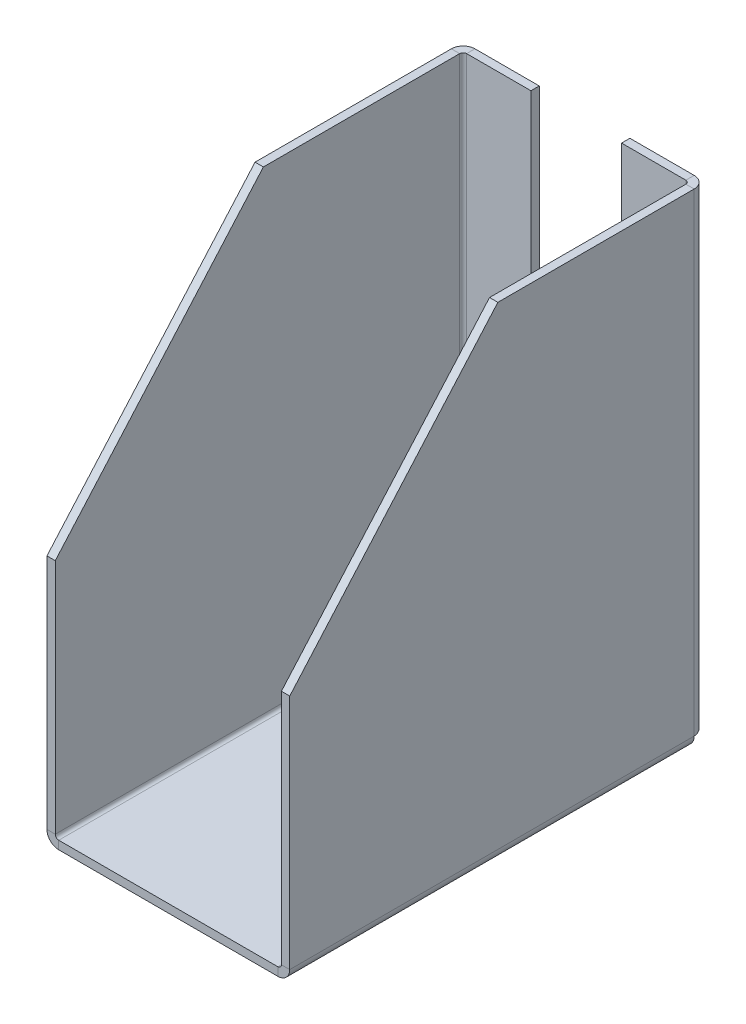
ISO-10303-21;
HEADER;
FILE_DESCRIPTION(('STEP AP214'),'2;1');
FILE_NAME('part.step','',(''),(''),'','','');
FILE_SCHEMA(('AUTOMOTIVE_DESIGN { 1 0 10303 214 1 1 1 1 }'));
ENDSEC;
DATA;
#1=APPLICATION_CONTEXT('core data for automotive mechanical design processes');
#2=APPLICATION_PROTOCOL_DEFINITION('international standard','automotive_design',2000,#1);
#3=PRODUCT_CONTEXT('',#1,'mechanical');
#4=PRODUCT('Part','Part','',(#3));
#5=PRODUCT_RELATED_PRODUCT_CATEGORY('part','',(#4));
#6=PRODUCT_DEFINITION_FORMATION('','',#4);
#7=PRODUCT_DEFINITION_CONTEXT('part definition',#1,'design');
#8=PRODUCT_DEFINITION('design','',#6,#7);
#9=PRODUCT_DEFINITION_SHAPE('','',#8);
#10=(LENGTH_UNIT() NAMED_UNIT(*) SI_UNIT(.MILLI.,.METRE.));
#11=(NAMED_UNIT(*) PLANE_ANGLE_UNIT() SI_UNIT($,.RADIAN.));
#12=(NAMED_UNIT(*) SI_UNIT($,.STERADIAN.) SOLID_ANGLE_UNIT());
#13=UNCERTAINTY_MEASURE_WITH_UNIT(LENGTH_MEASURE(1.E-05),#10,'distance_accuracy_value','');
#14=(GEOMETRIC_REPRESENTATION_CONTEXT(3) GLOBAL_UNCERTAINTY_ASSIGNED_CONTEXT((#13)) GLOBAL_UNIT_ASSIGNED_CONTEXT((#10,
#11,#12)) REPRESENTATION_CONTEXT('',''));
#15=CARTESIAN_POINT('',(0.,0.,0.));
#16=DIRECTION('',(0.,0.,1.));
#17=DIRECTION('',(1.,0.,0.));
#18=AXIS2_PLACEMENT_3D('',#15,#16,#17);
#19=CARTESIAN_POINT('',(22.225,0.,76.2));
#20=DIRECTION('',(1.,0.,0.));
#21=DIRECTION('',(0.,0.,-1.));
#22=AXIS2_PLACEMENT_3D('',#19,#20,#21);
#23=PLANE('',#22);
#24=DIRECTION('',(0.,0.,-1.));
#25=VECTOR('',#24,1.);
#26=CARTESIAN_POINT('',(22.225,2.159,76.2));
#27=LINE('',#26,#25);
#28=CARTESIAN_POINT('',(22.225,2.159,76.2));
#29=VERTEX_POINT('',#28);
#30=CARTESIAN_POINT('',(22.225,2.15899999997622,2.159));
#31=VERTEX_POINT('',#30);
#32=EDGE_CURVE('E213',#29,#31,#27,.T.);
#33=ORIENTED_EDGE('',*,*,#32,.T.);
#34=DIRECTION('',(0.,1.,0.));
#35=VECTOR('',#34,1.);
#36=CARTESIAN_POINT('',(22.225,2.15899999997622,2.159));
#37=LINE('',#36,#35);
#38=CARTESIAN_POINT('',(22.225,88.9,2.159));
#39=VERTEX_POINT('',#38);
#40=EDGE_CURVE('E217',#31,#39,#37,.T.);
#41=ORIENTED_EDGE('',*,*,#40,.T.);
#42=DIRECTION('',(0.,0.,-1.));
#43=VECTOR('',#42,1.);
#44=CARTESIAN_POINT('',(22.225,88.9,76.2));
#45=LINE('',#44,#43);
#46=CARTESIAN_POINT('',(22.225,88.9,38.1));
#47=VERTEX_POINT('',#46);
#48=EDGE_CURVE('E227',#47,#39,#45,.T.);
#49=ORIENTED_EDGE('',*,*,#48,.F.);
#50=DIRECTION('',(0.,0.75128058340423,-0.659982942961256));
#51=VECTOR('',#50,1.);
#52=CARTESIAN_POINT('',(22.225,19.8316251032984,98.7749999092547));
#53=LINE('',#52,#51);
#54=CARTESIAN_POINT('',(22.225,45.5295,76.2));
#55=VERTEX_POINT('',#54);
#56=EDGE_CURVE('E422',#55,#47,#53,.T.);
#57=ORIENTED_EDGE('',*,*,#56,.F.);
#58=DIRECTION('',(0.,-1.,0.));
#59=VECTOR('',#58,1.);
#60=CARTESIAN_POINT('',(22.225,0.,76.2));
#61=LINE('',#60,#59);
#62=EDGE_CURVE('E221',#55,#29,#61,.T.);
#63=ORIENTED_EDGE('',*,*,#62,.T.);
#64=EDGE_LOOP('',(#33,#41,#49,#57,#63));
#65=FACE_BOUND('',#64,.T.);
#66=ADVANCED_FACE('F39',(#65),#23,.T.);
#67=CARTESIAN_POINT('',(20.701,88.9,76.2));
#68=DIRECTION('',(0.,1.,0.));
#69=DIRECTION('',(-1.,0.,0.));
#70=AXIS2_PLACEMENT_3D('',#67,#68,#69);
#71=PLANE('',#70);
#72=ORIENTED_EDGE('',*,*,#48,.T.);
#73=DIRECTION('',(-1.,0.,0.));
#74=VECTOR('',#73,1.);
#75=CARTESIAN_POINT('',(22.225,88.9000000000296,2.159));
#76=LINE('',#75,#74);
#77=CARTESIAN_POINT('',(20.701,88.9,2.159));
#78=VERTEX_POINT('',#77);
#79=EDGE_CURVE('E250',#39,#78,#76,.T.);
#80=ORIENTED_EDGE('',*,*,#79,.T.);
#81=DIRECTION('',(0.,0.,-1.));
#82=VECTOR('',#81,1.);
#83=CARTESIAN_POINT('',(20.701,88.9,76.2));
#84=LINE('',#83,#82);
#85=CARTESIAN_POINT('',(20.701,88.9,38.1));
#86=VERTEX_POINT('',#85);
#87=EDGE_CURVE('E468',#86,#78,#84,.T.);
#88=ORIENTED_EDGE('',*,*,#87,.F.);
#89=DIRECTION('',(-1.,0.,0.));
#90=VECTOR('',#89,1.);
#91=CARTESIAN_POINT('',(20.701,88.9,38.1));
#92=LINE('',#91,#90);
#93=EDGE_CURVE('E427',#86,#47,#92,.F.);
#94=ORIENTED_EDGE('',*,*,#93,.T.);
#95=EDGE_LOOP('',(#72,#80,#88,#94));
#96=FACE_BOUND('',#95,.T.);
#97=ADVANCED_FACE('F558',(#96),#71,.T.);
#98=CARTESIAN_POINT('',(20.701,0.,76.2));
#99=DIRECTION('',(1.,0.,0.));
#100=DIRECTION('',(0.,0.,-1.));
#101=AXIS2_PLACEMENT_3D('',#98,#99,#100);
#102=PLANE('',#101);
#103=DIRECTION('',(0.,1.,0.));
#104=VECTOR('',#103,1.);
#105=CARTESIAN_POINT('',(20.701,2.15899999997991,2.159));
#106=LINE('',#105,#104);
#107=CARTESIAN_POINT('',(20.701,2.159,2.159));
#108=VERTEX_POINT('',#107);
#109=EDGE_CURVE('E265',#108,#78,#106,.T.);
#110=ORIENTED_EDGE('',*,*,#109,.F.);
#111=DIRECTION('',(0.,0.,-1.));
#112=VECTOR('',#111,1.);
#113=CARTESIAN_POINT('',(20.701,2.159,76.2));
#114=LINE('',#113,#112);
#115=CARTESIAN_POINT('',(20.701,2.159,76.2));
#116=VERTEX_POINT('',#115);
#117=EDGE_CURVE('E465',#116,#108,#114,.T.);
#118=ORIENTED_EDGE('',*,*,#117,.F.);
#119=DIRECTION('',(0.,1.,0.));
#120=VECTOR('',#119,1.);
#121=CARTESIAN_POINT('',(20.701,0.,76.2));
#122=LINE('',#121,#120);
#123=CARTESIAN_POINT('',(20.701,45.5295,76.2));
#124=VERTEX_POINT('',#123);
#125=EDGE_CURVE('E446',#124,#116,#122,.F.);
#126=ORIENTED_EDGE('',*,*,#125,.F.);
#127=DIRECTION('',(0.,0.75128058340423,-0.659982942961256));
#128=VECTOR('',#127,1.);
#129=CARTESIAN_POINT('',(20.701,19.8316251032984,98.7749999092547));
#130=LINE('',#129,#128);
#131=EDGE_CURVE('E420',#124,#86,#130,.T.);
#132=ORIENTED_EDGE('',*,*,#131,.T.);
#133=ORIENTED_EDGE('',*,*,#87,.T.);
#134=EDGE_LOOP('',(#110,#118,#126,#132,#133));
#135=FACE_BOUND('',#134,.T.);
#136=ADVANCED_FACE('F498',(#135),#102,.F.);
#137=CARTESIAN_POINT('',(-22.225,0.,76.2));
#138=DIRECTION('',(0.,-1.,0.));
#139=DIRECTION('',(0.,0.,-1.));
#140=AXIS2_PLACEMENT_3D('',#137,#138,#139);
#141=PLANE('',#140);
#142=DIRECTION('',(0.,0.,-1.));
#143=VECTOR('',#142,1.);
#144=CARTESIAN_POINT('',(-20.066,0.,76.2));
#145=LINE('',#144,#143);
#146=CARTESIAN_POINT('',(-20.066,0.,76.2));
#147=VERTEX_POINT('',#146);
#148=CARTESIAN_POINT('',(-20.066,0.,2.159));
#149=VERTEX_POINT('',#148);
#150=EDGE_CURVE('E473',#147,#149,#145,.T.);
#151=ORIENTED_EDGE('',*,*,#150,.T.);
#152=DIRECTION('',(1.,0.,0.));
#153=VECTOR('',#152,1.);
#154=CARTESIAN_POINT('',(-20.0660000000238,0.,2.159));
#155=LINE('',#154,#153);
#156=CARTESIAN_POINT('',(20.066,0.,2.159));
#157=VERTEX_POINT('',#156);
#158=EDGE_CURVE('E299',#149,#157,#155,.T.);
#159=ORIENTED_EDGE('',*,*,#158,.T.);
#160=DIRECTION('',(0.,0.,-1.));
#161=VECTOR('',#160,1.);
#162=CARTESIAN_POINT('',(20.066,0.,76.2));
#163=LINE('',#162,#161);
#164=CARTESIAN_POINT('',(20.066,0.,76.2));
#165=VERTEX_POINT('',#164);
#166=EDGE_CURVE('E226',#165,#157,#163,.T.);
#167=ORIENTED_EDGE('',*,*,#166,.F.);
#168=DIRECTION('',(-1.,0.,0.));
#169=VECTOR('',#168,1.);
#170=CARTESIAN_POINT('',(-22.225,0.,76.2));
#171=LINE('',#170,#169);
#172=EDGE_CURVE('E440',#165,#147,#171,.T.);
#173=ORIENTED_EDGE('',*,*,#172,.T.);
#174=EDGE_LOOP('',(#151,#159,#167,#173));
#175=FACE_BOUND('',#174,.T.);
#176=ADVANCED_FACE('F513',(#175),#141,.T.);
#177=CARTESIAN_POINT('',(20.066,2.159,76.2));
#178=DIRECTION('',(0.,0.,-1.));
#179=DIRECTION('',(-1.,0.,0.));
#180=AXIS2_PLACEMENT_3D('',#177,#178,#179);
#181=CYLINDRICAL_SURFACE('',#180,2.159);
#182=ORIENTED_EDGE('',*,*,#166,.T.);
#183=CARTESIAN_POINT('',(20.066,2.159,2.159));
#184=DIRECTION('',(0.,0.,1.));
#185=DIRECTION('',(1.,0.,0.));
#186=AXIS2_PLACEMENT_3D('',#183,#184,#185);
#187=CIRCLE('',#186,2.159);
#188=EDGE_CURVE('E230',#31,#157,#187,.F.);
#189=ORIENTED_EDGE('',*,*,#188,.F.);
#190=ORIENTED_EDGE('',*,*,#32,.F.);
#191=CARTESIAN_POINT('',(20.066,2.159,76.2));
#192=DIRECTION('',(0.,0.,1.));
#193=DIRECTION('',(1.,0.,0.));
#194=AXIS2_PLACEMENT_3D('',#191,#192,#193);
#195=CIRCLE('',#194,2.159);
#196=EDGE_CURVE('E443',#29,#165,#195,.F.);
#197=ORIENTED_EDGE('',*,*,#196,.T.);
#198=EDGE_LOOP('',(#182,#189,#190,#197));
#199=FACE_BOUND('',#198,.T.);
#200=ADVANCED_FACE('F232',(#199),#181,.T.);
#201=CARTESIAN_POINT('',(20.066,2.159,76.2));
#202=DIRECTION('',(0.,0.,-1.));
#203=DIRECTION('',(-1.,0.,0.));
#204=AXIS2_PLACEMENT_3D('',#201,#202,#203);
#205=CYLINDRICAL_SURFACE('',#204,0.635);
#206=CARTESIAN_POINT('',(20.066,2.159,2.159));
#207=DIRECTION('',(0.,0.,1.));
#208=DIRECTION('',(1.,0.,0.));
#209=AXIS2_PLACEMENT_3D('',#206,#207,#208);
#210=CIRCLE('',#209,0.635);
#211=CARTESIAN_POINT('',(20.066,1.524,2.159));
#212=VERTEX_POINT('',#211);
#213=EDGE_CURVE('E237',#108,#212,#210,.F.);
#214=ORIENTED_EDGE('',*,*,#213,.T.);
#215=DIRECTION('',(0.,0.,-1.));
#216=VECTOR('',#215,1.);
#217=CARTESIAN_POINT('',(20.066,1.524,76.2));
#218=LINE('',#217,#216);
#219=CARTESIAN_POINT('',(20.066,1.524,76.2));
#220=VERTEX_POINT('',#219);
#221=EDGE_CURVE('E462',#220,#212,#218,.T.);
#222=ORIENTED_EDGE('',*,*,#221,.F.);
#223=CARTESIAN_POINT('',(20.066,2.159,76.2));
#224=DIRECTION('',(0.,0.,1.));
#225=DIRECTION('',(1.,0.,0.));
#226=AXIS2_PLACEMENT_3D('',#223,#224,#225);
#227=CIRCLE('',#226,0.635);
#228=EDGE_CURVE('E448',#116,#220,#227,.F.);
#229=ORIENTED_EDGE('',*,*,#228,.F.);
#230=ORIENTED_EDGE('',*,*,#117,.T.);
#231=EDGE_LOOP('',(#214,#222,#229,#230));
#232=FACE_BOUND('',#231,.T.);
#233=ADVANCED_FACE('F501',(#232),#205,.F.);
#234=CARTESIAN_POINT('',(-22.225,1.524,76.2));
#235=DIRECTION('',(0.,-1.,0.));
#236=DIRECTION('',(0.,0.,-1.));
#237=AXIS2_PLACEMENT_3D('',#234,#235,#236);
#238=PLANE('',#237);
#239=DIRECTION('',(1.,0.,0.));
#240=VECTOR('',#239,1.);
#241=CARTESIAN_POINT('',(-20.0660000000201,1.524,2.159));
#242=LINE('',#241,#240);
#243=CARTESIAN_POINT('',(-20.0660000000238,1.524,2.159));
#244=VERTEX_POINT('',#243);
#245=EDGE_CURVE('E301',#244,#212,#242,.T.);
#246=ORIENTED_EDGE('',*,*,#245,.F.);
#247=DIRECTION('',(0.,0.,-1.));
#248=VECTOR('',#247,1.);
#249=CARTESIAN_POINT('',(-20.066,1.524,76.2));
#250=LINE('',#249,#248);
#251=CARTESIAN_POINT('',(-20.066,1.524,76.2));
#252=VERTEX_POINT('',#251);
#253=EDGE_CURVE('E460',#252,#244,#250,.T.);
#254=ORIENTED_EDGE('',*,*,#253,.F.);
#255=DIRECTION('',(1.,0.,0.));
#256=VECTOR('',#255,1.);
#257=CARTESIAN_POINT('',(-22.225,1.524,76.2));
#258=LINE('',#257,#256);
#259=EDGE_CURVE('E451',#220,#252,#258,.F.);
#260=ORIENTED_EDGE('',*,*,#259,.F.);
#261=ORIENTED_EDGE('',*,*,#221,.T.);
#262=EDGE_LOOP('',(#246,#254,#260,#261));
#263=FACE_BOUND('',#262,.T.);
#264=ADVANCED_FACE('F506',(#263),#238,.F.);
#265=CARTESIAN_POINT('',(-20.066,1.524,76.2));
#266=DIRECTION('',(0.,0.,1.));
#267=DIRECTION('',(1.,0.,0.));
#268=AXIS2_PLACEMENT_3D('',#265,#266,#267);
#269=PLANE('',#268);
#270=DIRECTION('',(0.,1.,0.));
#271=VECTOR('',#270,1.);
#272=CARTESIAN_POINT('',(-20.701,0.,76.2));
#273=LINE('',#272,#271);
#274=CARTESIAN_POINT('',(-20.701,2.159,76.2));
#275=VERTEX_POINT('',#274);
#276=CARTESIAN_POINT('',(-20.701,45.5295,76.2));
#277=VERTEX_POINT('',#276);
#278=EDGE_CURVE('E430',#275,#277,#273,.T.);
#279=ORIENTED_EDGE('',*,*,#278,.T.);
#280=DIRECTION('',(1.,0.,0.));
#281=VECTOR('',#280,1.);
#282=CARTESIAN_POINT('',(-20.701,45.5295,76.2));
#283=LINE('',#282,#281);
#284=CARTESIAN_POINT('',(-22.225,45.5295,76.2));
#285=VERTEX_POINT('',#284);
#286=EDGE_CURVE('E417',#277,#285,#283,.F.);
#287=ORIENTED_EDGE('',*,*,#286,.T.);
#288=DIRECTION('',(0.,1.,0.));
#289=VECTOR('',#288,1.);
#290=CARTESIAN_POINT('',(-22.225,0.,76.2));
#291=LINE('',#290,#289);
#292=CARTESIAN_POINT('',(-22.225,2.159,76.2));
#293=VERTEX_POINT('',#292);
#294=EDGE_CURVE('E434',#293,#285,#291,.T.);
#295=ORIENTED_EDGE('',*,*,#294,.F.);
#296=DIRECTION('',(1.,0.,0.));
#297=VECTOR('',#296,1.);
#298=CARTESIAN_POINT('',(-22.225,2.159,76.2));
#299=LINE('',#298,#297);
#300=EDGE_CURVE('E486',#293,#275,#299,.T.);
#301=ORIENTED_EDGE('',*,*,#300,.T.);
#302=EDGE_LOOP('',(#279,#287,#295,#301));
#303=FACE_BOUND('',#302,.T.);
#304=ADVANCED_FACE('F588',(#303),#269,.T.);
#305=CARTESIAN_POINT('',(-20.701,0.,76.2));
#306=DIRECTION('',(-1.,0.,0.));
#307=DIRECTION('',(0.,0.,1.));
#308=AXIS2_PLACEMENT_3D('',#305,#306,#307);
#309=PLANE('',#308);
#310=DIRECTION('',(0.,0.,-1.));
#311=VECTOR('',#310,1.);
#312=CARTESIAN_POINT('',(-20.701,2.159,76.2));
#313=LINE('',#312,#311);
#314=CARTESIAN_POINT('',(-20.701,2.159,2.15900000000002));
#315=VERTEX_POINT('',#314);
#316=EDGE_CURVE('E457',#275,#315,#313,.T.);
#317=ORIENTED_EDGE('',*,*,#316,.T.);
#318=DIRECTION('',(0.,-1.,0.));
#319=VECTOR('',#318,1.);
#320=CARTESIAN_POINT('',(-20.701,522.60500000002,2.159));
#321=LINE('',#320,#319);
#322=CARTESIAN_POINT('',(-20.701,88.9,2.159));
#323=VERTEX_POINT('',#322);
#324=EDGE_CURVE('E355',#323,#315,#321,.T.);
#325=ORIENTED_EDGE('',*,*,#324,.F.);
#326=DIRECTION('',(0.,0.,-1.));
#327=VECTOR('',#326,1.);
#328=CARTESIAN_POINT('',(-20.701,88.9,76.2));
#329=LINE('',#328,#327);
#330=CARTESIAN_POINT('',(-20.701,88.9,38.1));
#331=VERTEX_POINT('',#330);
#332=EDGE_CURVE('E481',#331,#323,#329,.T.);
#333=ORIENTED_EDGE('',*,*,#332,.F.);
#334=DIRECTION('',(0.,-0.75128058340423,0.659982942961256));
#335=VECTOR('',#334,1.);
#336=CARTESIAN_POINT('',(-20.701,19.8316251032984,98.7749999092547));
#337=LINE('',#336,#335);
#338=EDGE_CURVE('E410',#331,#277,#337,.T.);
#339=ORIENTED_EDGE('',*,*,#338,.T.);
#340=ORIENTED_EDGE('',*,*,#278,.F.);
#341=EDGE_LOOP('',(#317,#325,#333,#339,#340));
#342=FACE_BOUND('',#341,.T.);
#343=ADVANCED_FACE('F584',(#342),#309,.F.);
#344=CARTESIAN_POINT('',(-22.225,88.9,76.2));
#345=DIRECTION('',(0.,1.,0.));
#346=DIRECTION('',(-1.,0.,0.));
#347=AXIS2_PLACEMENT_3D('',#344,#345,#346);
#348=PLANE('',#347);
#349=DIRECTION('',(1.,0.,0.));
#350=VECTOR('',#349,1.);
#351=CARTESIAN_POINT('',(-22.225,88.9000000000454,2.159));
#352=LINE('',#351,#350);
#353=CARTESIAN_POINT('',(-22.225,88.9000000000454,2.159));
#354=VERTEX_POINT('',#353);
#355=EDGE_CURVE('E372',#354,#323,#352,.T.);
#356=ORIENTED_EDGE('',*,*,#355,.F.);
#357=DIRECTION('',(0.,0.,-1.));
#358=VECTOR('',#357,1.);
#359=CARTESIAN_POINT('',(-22.225,88.9,76.2));
#360=LINE('',#359,#358);
#361=CARTESIAN_POINT('',(-22.225,88.9,38.1));
#362=VERTEX_POINT('',#361);
#363=EDGE_CURVE('E479',#362,#354,#360,.T.);
#364=ORIENTED_EDGE('',*,*,#363,.F.);
#365=DIRECTION('',(1.,0.,0.));
#366=VECTOR('',#365,1.);
#367=CARTESIAN_POINT('',(-20.701,88.9,38.1));
#368=LINE('',#367,#366);
#369=EDGE_CURVE('E64',#331,#362,#368,.F.);
#370=ORIENTED_EDGE('',*,*,#369,.F.);
#371=ORIENTED_EDGE('',*,*,#332,.T.);
#372=EDGE_LOOP('',(#356,#364,#370,#371));
#373=FACE_BOUND('',#372,.T.);
#374=ADVANCED_FACE('F580',(#373),#348,.T.);
#375=CARTESIAN_POINT('',(-22.225,0.,76.2));
#376=DIRECTION('',(-1.,0.,0.));
#377=DIRECTION('',(0.,0.,1.));
#378=AXIS2_PLACEMENT_3D('',#375,#376,#377);
#379=PLANE('',#378);
#380=DIRECTION('',(0.,-1.,0.));
#381=VECTOR('',#380,1.);
#382=CARTESIAN_POINT('',(-22.225,522.605000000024,2.159));
#383=LINE('',#382,#381);
#384=CARTESIAN_POINT('',(-22.225,2.159,2.159));
#385=VERTEX_POINT('',#384);
#386=EDGE_CURVE('E352',#354,#385,#383,.T.);
#387=ORIENTED_EDGE('',*,*,#386,.T.);
#388=DIRECTION('',(0.,0.,-1.));
#389=VECTOR('',#388,1.);
#390=CARTESIAN_POINT('',(-22.225,2.159,76.2));
#391=LINE('',#390,#389);
#392=EDGE_CURVE('E476',#293,#385,#391,.T.);
#393=ORIENTED_EDGE('',*,*,#392,.F.);
#394=ORIENTED_EDGE('',*,*,#294,.T.);
#395=DIRECTION('',(0.,-0.75128058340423,0.659982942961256));
#396=VECTOR('',#395,1.);
#397=CARTESIAN_POINT('',(-22.225,19.8316251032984,98.7749999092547));
#398=LINE('',#397,#396);
#399=EDGE_CURVE('E413',#362,#285,#398,.T.);
#400=ORIENTED_EDGE('',*,*,#399,.F.);
#401=ORIENTED_EDGE('',*,*,#363,.T.);
#402=EDGE_LOOP('',(#387,#393,#394,#400,#401));
#403=FACE_BOUND('',#402,.T.);
#404=ADVANCED_FACE('F577',(#403),#379,.T.);
#405=CARTESIAN_POINT('',(-20.066,2.159,76.2));
#406=DIRECTION('',(0.,0.,1.));
#407=DIRECTION('',(1.,0.,0.));
#408=AXIS2_PLACEMENT_3D('',#405,#406,#407);
#409=PLANE('',#408);
#410=ORIENTED_EDGE('',*,*,#62,.F.);
#411=DIRECTION('',(-1.,0.,0.));
#412=VECTOR('',#411,1.);
#413=CARTESIAN_POINT('',(20.701,45.5295,76.2));
#414=LINE('',#413,#412);
#415=EDGE_CURVE('E424',#124,#55,#414,.F.);
#416=ORIENTED_EDGE('',*,*,#415,.F.);
#417=ORIENTED_EDGE('',*,*,#125,.T.);
#418=DIRECTION('',(1.,0.,0.));
#419=VECTOR('',#418,1.);
#420=CARTESIAN_POINT('',(20.701,2.159,76.2));
#421=LINE('',#420,#419);
#422=EDGE_CURVE('E49',#116,#29,#421,.T.);
#423=ORIENTED_EDGE('',*,*,#422,.T.);
#424=EDGE_LOOP('',(#410,#416,#417,#423));
#425=FACE_BOUND('',#424,.T.);
#426=ADVANCED_FACE('F489',(#425),#409,.T.);
#427=CARTESIAN_POINT('',(20.066,0.,76.2));
#428=DIRECTION('',(0.,0.,1.));
#429=DIRECTION('',(1.,0.,0.));
#430=AXIS2_PLACEMENT_3D('',#427,#428,#429);
#431=PLANE('',#430);
#432=DIRECTION('',(0.,1.,0.));
#433=VECTOR('',#432,1.);
#434=CARTESIAN_POINT('',(20.066,0.,76.2));
#435=LINE('',#434,#433);
#436=EDGE_CURVE('E11',#165,#220,#435,.T.);
#437=ORIENTED_EDGE('',*,*,#436,.F.);
#438=ORIENTED_EDGE('',*,*,#196,.F.);
#439=ORIENTED_EDGE('',*,*,#422,.F.);
#440=ORIENTED_EDGE('',*,*,#228,.T.);
#441=EDGE_LOOP('',(#437,#438,#439,#440));
#442=FACE_BOUND('',#441,.T.);
#443=ADVANCED_FACE('F494',(#442),#431,.T.);
#444=CARTESIAN_POINT('',(20.701,2.159,76.2));
#445=DIRECTION('',(0.,0.,1.));
#446=DIRECTION('',(1.,0.,0.));
#447=AXIS2_PLACEMENT_3D('',#444,#445,#446);
#448=PLANE('',#447);
#449=ORIENTED_EDGE('',*,*,#172,.F.);
#450=ORIENTED_EDGE('',*,*,#436,.T.);
#451=ORIENTED_EDGE('',*,*,#259,.T.);
#452=DIRECTION('',(0.,-1.,0.));
#453=VECTOR('',#452,1.);
#454=CARTESIAN_POINT('',(-20.066,1.524,76.2));
#455=LINE('',#454,#453);
#456=EDGE_CURVE('E484',#252,#147,#455,.T.);
#457=ORIENTED_EDGE('',*,*,#456,.T.);
#458=EDGE_LOOP('',(#449,#450,#451,#457));
#459=FACE_BOUND('',#458,.T.);
#460=ADVANCED_FACE('F510',(#459),#448,.T.);
#461=CARTESIAN_POINT('',(-22.225,2.159,76.2));
#462=DIRECTION('',(0.,0.,1.));
#463=DIRECTION('',(1.,0.,0.));
#464=AXIS2_PLACEMENT_3D('',#461,#462,#463);
#465=PLANE('',#464);
#466=ORIENTED_EDGE('',*,*,#300,.F.);
#467=CARTESIAN_POINT('',(-20.066,2.159,76.2));
#468=DIRECTION('',(0.,0.,1.));
#469=DIRECTION('',(1.,0.,0.));
#470=AXIS2_PLACEMENT_3D('',#467,#468,#469);
#471=CIRCLE('',#470,2.159);
#472=EDGE_CURVE('E437',#147,#293,#471,.F.);
#473=ORIENTED_EDGE('',*,*,#472,.F.);
#474=ORIENTED_EDGE('',*,*,#456,.F.);
#475=CARTESIAN_POINT('',(-20.066,2.159,76.2));
#476=DIRECTION('',(0.,0.,1.));
#477=DIRECTION('',(1.,0.,0.));
#478=AXIS2_PLACEMENT_3D('',#475,#476,#477);
#479=CIRCLE('',#478,0.635);
#480=EDGE_CURVE('E454',#252,#275,#479,.F.);
#481=ORIENTED_EDGE('',*,*,#480,.T.);
#482=EDGE_LOOP('',(#466,#473,#474,#481));
#483=FACE_BOUND('',#482,.T.);
#484=ADVANCED_FACE('F575',(#483),#465,.T.);
#485=CARTESIAN_POINT('',(-20.066,2.159,76.2));
#486=DIRECTION('',(0.,0.,-1.));
#487=DIRECTION('',(-1.,0.,0.));
#488=AXIS2_PLACEMENT_3D('',#485,#486,#487);
#489=CYLINDRICAL_SURFACE('',#488,2.159);
#490=CARTESIAN_POINT('',(-20.066,2.159,2.159));
#491=DIRECTION('',(0.,0.,1.));
#492=DIRECTION('',(1.,0.,0.));
#493=AXIS2_PLACEMENT_3D('',#490,#491,#492);
#494=CIRCLE('',#493,2.159);
#495=EDGE_CURVE('E406',#149,#385,#494,.F.);
#496=ORIENTED_EDGE('',*,*,#495,.F.);
#497=ORIENTED_EDGE('',*,*,#150,.F.);
#498=ORIENTED_EDGE('',*,*,#472,.T.);
#499=ORIENTED_EDGE('',*,*,#392,.T.);
#500=EDGE_LOOP('',(#496,#497,#498,#499));
#501=FACE_BOUND('',#500,.T.);
#502=ADVANCED_FACE('F571',(#501),#489,.T.);
#503=CARTESIAN_POINT('',(-20.066,2.159,76.2));
#504=DIRECTION('',(0.,0.,-1.));
#505=DIRECTION('',(-1.,0.,0.));
#506=AXIS2_PLACEMENT_3D('',#503,#504,#505);
#507=CYLINDRICAL_SURFACE('',#506,0.635);
#508=ORIENTED_EDGE('',*,*,#253,.T.);
#509=CARTESIAN_POINT('',(-20.066,2.159,2.159));
#510=DIRECTION('',(0.,0.,1.));
#511=DIRECTION('',(1.,0.,0.));
#512=AXIS2_PLACEMENT_3D('',#509,#510,#511);
#513=CIRCLE('',#512,0.635);
#514=EDGE_CURVE('E238',#244,#315,#513,.F.);
#515=ORIENTED_EDGE('',*,*,#514,.T.);
#516=ORIENTED_EDGE('',*,*,#316,.F.);
#517=ORIENTED_EDGE('',*,*,#480,.F.);
#518=EDGE_LOOP('',(#508,#515,#516,#517));
#519=FACE_BOUND('',#518,.T.);
#520=ADVANCED_FACE('F574',(#519),#507,.F.);
#521=CARTESIAN_POINT('',(20.701,19.8316251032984,98.7749999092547));
#522=DIRECTION('',(0.,-0.659982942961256,-0.75128058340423));
#523=DIRECTION('',(0.,0.75128058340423,-0.659982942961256));
#524=AXIS2_PLACEMENT_3D('',#521,#522,#523);
#525=PLANE('',#524);
#526=ORIENTED_EDGE('',*,*,#93,.F.);
#527=ORIENTED_EDGE('',*,*,#131,.F.);
#528=ORIENTED_EDGE('',*,*,#415,.T.);
#529=ORIENTED_EDGE('',*,*,#56,.T.);
#530=EDGE_LOOP('',(#526,#527,#528,#529));
#531=FACE_BOUND('',#530,.T.);
#532=ADVANCED_FACE('F708',(#531),#525,.F.);
#533=CARTESIAN_POINT('',(-20.701,19.8316251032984,98.7749999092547));
#534=DIRECTION('',(0.,-0.659982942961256,-0.75128058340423));
#535=DIRECTION('',(0.,-0.75128058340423,0.659982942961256));
#536=AXIS2_PLACEMENT_3D('',#533,#534,#535);
#537=PLANE('',#536);
#538=ORIENTED_EDGE('',*,*,#286,.F.);
#539=ORIENTED_EDGE('',*,*,#338,.F.);
#540=ORIENTED_EDGE('',*,*,#369,.T.);
#541=ORIENTED_EDGE('',*,*,#399,.T.);
#542=EDGE_LOOP('',(#538,#539,#540,#541));
#543=FACE_BOUND('',#542,.T.);
#544=ADVANCED_FACE('F703',(#543),#537,.F.);
#545=CARTESIAN_POINT('',(22.225,2.159,2.159));
#546=DIRECTION('',(0.,0.,-1.));
#547=DIRECTION('',(-1.,0.,0.));
#548=AXIS2_PLACEMENT_3D('',#545,#546,#547);
#549=PLANE('',#548);
#550=DIRECTION('',(-1.,0.,0.));
#551=VECTOR('',#550,1.);
#552=CARTESIAN_POINT('',(22.225,2.15899999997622,2.159));
#553=LINE('',#552,#551);
#554=EDGE_CURVE('E241',#31,#108,#553,.T.);
#555=ORIENTED_EDGE('',*,*,#554,.F.);
#556=ORIENTED_EDGE('',*,*,#188,.T.);
#557=DIRECTION('',(0.,1.,0.));
#558=VECTOR('',#557,1.);
#559=CARTESIAN_POINT('',(20.066,0.,2.159));
#560=LINE('',#559,#558);
#561=EDGE_CURVE('E311',#157,#212,#560,.T.);
#562=ORIENTED_EDGE('',*,*,#561,.T.);
#563=ORIENTED_EDGE('',*,*,#213,.F.);
#564=EDGE_LOOP('',(#555,#556,#562,#563));
#565=FACE_BOUND('',#564,.T.);
#566=ADVANCED_FACE('F242',(#565),#549,.T.);
#567=CARTESIAN_POINT('',(-20.066,2.159,2.159));
#568=DIRECTION('',(0.,0.,1.));
#569=DIRECTION('',(1.,0.,0.));
#570=AXIS2_PLACEMENT_3D('',#567,#568,#569);
#571=PLANE('',#570);
#572=ORIENTED_EDGE('',*,*,#495,.T.);
#573=DIRECTION('',(1.,1.02846042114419E-13,0.));
#574=VECTOR('',#573,1.);
#575=CARTESIAN_POINT('',(-22.225,2.15900000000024,2.159));
#576=LINE('',#575,#574);
#577=EDGE_CURVE('E56',#385,#315,#576,.T.);
#578=ORIENTED_EDGE('',*,*,#577,.T.);
#579=ORIENTED_EDGE('',*,*,#514,.F.);
#580=DIRECTION('',(0.,1.,0.));
#581=VECTOR('',#580,1.);
#582=CARTESIAN_POINT('',(-20.0660000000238,0.,2.159));
#583=LINE('',#582,#581);
#584=EDGE_CURVE('E318',#149,#244,#583,.T.);
#585=ORIENTED_EDGE('',*,*,#584,.F.);
#586=EDGE_LOOP('',(#572,#578,#579,#585));
#587=FACE_BOUND('',#586,.T.);
#588=ADVANCED_FACE('F696',(#587),#571,.F.);
#589=CARTESIAN_POINT('',(-8.29641223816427,88.9,0.));
#590=DIRECTION('',(1.,0.,0.));
#591=DIRECTION('',(0.,1.,0.));
#592=AXIS2_PLACEMENT_3D('',#589,#590,#591);
#593=PLANE('',#592);
#594=DIRECTION('',(0.,0.,1.));
#595=VECTOR('',#594,1.);
#596=CARTESIAN_POINT('',(-8.29641223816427,14.1081928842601,0.));
#597=LINE('',#596,#595);
#598=CARTESIAN_POINT('',(-8.29641223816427,14.1081928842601,0.));
#599=VERTEX_POINT('',#598);
#600=CARTESIAN_POINT('',(-8.29641223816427,14.1081928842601,1.524));
#601=VERTEX_POINT('',#600);
#602=EDGE_CURVE('E404',#599,#601,#597,.T.);
#603=ORIENTED_EDGE('',*,*,#602,.F.);
#604=DIRECTION('',(0.,1.,0.));
#605=VECTOR('',#604,1.);
#606=CARTESIAN_POINT('',(-8.29641223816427,88.9,0.));
#607=LINE('',#606,#605);
#608=CARTESIAN_POINT('',(-8.29641223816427,88.9,0.));
#609=VERTEX_POINT('',#608);
#610=EDGE_CURVE('E375',#609,#599,#607,.F.);
#611=ORIENTED_EDGE('',*,*,#610,.F.);
#612=DIRECTION('',(0.,0.,1.));
#613=VECTOR('',#612,1.);
#614=CARTESIAN_POINT('',(-8.29641223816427,88.9,0.));
#615=LINE('',#614,#613);
#616=CARTESIAN_POINT('',(-8.29641223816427,88.9,1.524));
#617=VERTEX_POINT('',#616);
#618=EDGE_CURVE('E402',#609,#617,#615,.T.);
#619=ORIENTED_EDGE('',*,*,#618,.T.);
#620=DIRECTION('',(0.,1.,0.));
#621=VECTOR('',#620,1.);
#622=CARTESIAN_POINT('',(-8.29641223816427,88.9,1.524));
#623=LINE('',#622,#621);
#624=EDGE_CURVE('E383',#617,#601,#623,.F.);
#625=ORIENTED_EDGE('',*,*,#624,.T.);
#626=EDGE_LOOP('',(#603,#611,#619,#625));
#627=FACE_BOUND('',#626,.T.);
#628=ADVANCED_FACE('F692',(#627),#593,.T.);
#629=CARTESIAN_POINT('',(-8.29641223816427,88.9,0.));
#630=DIRECTION('',(0.,-1.,0.));
#631=DIRECTION('',(1.,0.,0.));
#632=AXIS2_PLACEMENT_3D('',#629,#630,#631);
#633=PLANE('',#632);
#634=ORIENTED_EDGE('',*,*,#618,.F.);
#635=DIRECTION('',(1.,0.,0.));
#636=VECTOR('',#635,1.);
#637=CARTESIAN_POINT('',(-8.29641223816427,88.9,0.));
#638=LINE('',#637,#636);
#639=CARTESIAN_POINT('',(-20.066,88.90000000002,0.));
#640=VERTEX_POINT('',#639);
#641=EDGE_CURVE('E393',#609,#640,#638,.F.);
#642=ORIENTED_EDGE('',*,*,#641,.T.);
#643=DIRECTION('',(0.,0.,1.));
#644=VECTOR('',#643,1.);
#645=CARTESIAN_POINT('',(-20.066,88.90000000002,0.));
#646=LINE('',#645,#644);
#647=CARTESIAN_POINT('',(-20.066,88.90000000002,1.524));
#648=VERTEX_POINT('',#647);
#649=EDGE_CURVE('E400',#640,#648,#646,.T.);
#650=ORIENTED_EDGE('',*,*,#649,.T.);
#651=DIRECTION('',(1.,0.,0.));
#652=VECTOR('',#651,1.);
#653=CARTESIAN_POINT('',(-8.29641223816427,88.9,1.524));
#654=LINE('',#653,#652);
#655=EDGE_CURVE('E380',#617,#648,#654,.F.);
#656=ORIENTED_EDGE('',*,*,#655,.F.);
#657=EDGE_LOOP('',(#634,#642,#650,#656));
#658=FACE_BOUND('',#657,.T.);
#659=ADVANCED_FACE('F686',(#658),#633,.F.);
#660=CARTESIAN_POINT('',(29.0994913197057,51.5040964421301,0.));
#661=DIRECTION('',(0.707106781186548,-0.707106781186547,0.));
#662=DIRECTION('',(0.707106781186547,0.707106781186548,0.));
#663=AXIS2_PLACEMENT_3D('',#660,#661,#662);
#664=PLANE('',#663);
#665=DIRECTION('',(0.707106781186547,0.707106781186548,0.));
#666=VECTOR('',#665,1.);
#667=CARTESIAN_POINT('',(29.0994913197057,51.5040964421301,0.));
#668=LINE('',#667,#666);
#669=CARTESIAN_POINT('',(-20.066,2.33860512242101,0.));
#670=VERTEX_POINT('',#669);
#671=EDGE_CURVE('E386',#670,#599,#668,.T.);
#672=ORIENTED_EDGE('',*,*,#671,.T.);
#673=ORIENTED_EDGE('',*,*,#602,.T.);
#674=DIRECTION('',(0.707106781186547,0.707106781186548,0.));
#675=VECTOR('',#674,1.);
#676=CARTESIAN_POINT('',(29.0994913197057,51.5040964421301,1.524));
#677=LINE('',#676,#675);
#678=CARTESIAN_POINT('',(-20.066,2.33860512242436,1.524));
#679=VERTEX_POINT('',#678);
#680=EDGE_CURVE('E379',#679,#601,#677,.T.);
#681=ORIENTED_EDGE('',*,*,#680,.F.);
#682=DIRECTION('',(0.,0.,1.));
#683=VECTOR('',#682,1.);
#684=CARTESIAN_POINT('',(-20.066,2.33860512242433,0.));
#685=LINE('',#684,#683);
#686=EDGE_CURVE('E389',#670,#679,#685,.T.);
#687=ORIENTED_EDGE('',*,*,#686,.F.);
#688=EDGE_LOOP('',(#672,#673,#681,#687));
#689=FACE_BOUND('',#688,.T.);
#690=ADVANCED_FACE('F684',(#689),#664,.T.);
#691=CARTESIAN_POINT('',(-8.29641223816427,88.9,1.524));
#692=DIRECTION('',(0.,0.,1.));
#693=DIRECTION('',(1.,0.,0.));
#694=AXIS2_PLACEMENT_3D('',#691,#692,#693);
#695=PLANE('',#694);
#696=DIRECTION('',(0.,1.,0.));
#697=VECTOR('',#696,1.);
#698=CARTESIAN_POINT('',(-20.066,88.9,1.524));
#699=LINE('',#698,#697);
#700=EDGE_CURVE('E377',#648,#679,#699,.F.);
#701=ORIENTED_EDGE('',*,*,#700,.T.);
#702=ORIENTED_EDGE('',*,*,#680,.T.);
#703=ORIENTED_EDGE('',*,*,#624,.F.);
#704=ORIENTED_EDGE('',*,*,#655,.T.);
#705=EDGE_LOOP('',(#701,#702,#703,#704));
#706=FACE_BOUND('',#705,.T.);
#707=ADVANCED_FACE('F681',(#706),#695,.T.);
#708=CARTESIAN_POINT('',(-8.29641223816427,88.9,0.));
#709=DIRECTION('',(0.,0.,1.));
#710=DIRECTION('',(1.,0.,0.));
#711=AXIS2_PLACEMENT_3D('',#708,#709,#710);
#712=PLANE('',#711);
#713=DIRECTION('',(0.,1.,0.));
#714=VECTOR('',#713,1.);
#715=CARTESIAN_POINT('',(-20.066,88.9,0.));
#716=LINE('',#715,#714);
#717=EDGE_CURVE('E390',#640,#670,#716,.F.);
#718=ORIENTED_EDGE('',*,*,#717,.F.);
#719=ORIENTED_EDGE('',*,*,#641,.F.);
#720=ORIENTED_EDGE('',*,*,#610,.T.);
#721=ORIENTED_EDGE('',*,*,#671,.F.);
#722=EDGE_LOOP('',(#718,#719,#720,#721));
#723=FACE_BOUND('',#722,.T.);
#724=ADVANCED_FACE('F679',(#723),#712,.F.);
#725=CARTESIAN_POINT('',(-20.066,88.9000000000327,2.159));
#726=DIRECTION('',(0.,-1.,5.85684278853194E-12));
#727=DIRECTION('',(0.,-5.85684278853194E-12,-1.));
#728=AXIS2_PLACEMENT_3D('',#725,#726,#727);
#729=PLANE('',#728);
#730=ORIENTED_EDGE('',*,*,#649,.F.);
#731=CARTESIAN_POINT('',(-20.066,88.9000000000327,2.159));
#732=DIRECTION('',(0.,1.,-5.85684278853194E-12));
#733=DIRECTION('',(0.,5.85684278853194E-12,1.));
#734=AXIS2_PLACEMENT_3D('',#731,#732,#733);
#735=CIRCLE('',#734,2.159);
#736=EDGE_CURVE('E367',#640,#354,#735,.T.);
#737=ORIENTED_EDGE('',*,*,#736,.T.);
#738=ORIENTED_EDGE('',*,*,#355,.T.);
#739=CARTESIAN_POINT('',(-20.066,88.9000000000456,2.159));
#740=DIRECTION('',(0.,-1.,0.));
#741=DIRECTION('',(0.,0.,-1.));
#742=AXIS2_PLACEMENT_3D('',#739,#740,#741);
#743=CIRCLE('',#742,0.635);
#744=EDGE_CURVE('E358',#648,#323,#743,.F.);
#745=ORIENTED_EDGE('',*,*,#744,.F.);
#746=EDGE_LOOP('',(#730,#737,#738,#745));
#747=FACE_BOUND('',#746,.T.);
#748=ADVANCED_FACE('F675',(#747),#729,.F.);
#749=CARTESIAN_POINT('',(-20.066,1.97939487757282,2.794));
#750=CARTESIAN_POINT('',(-20.066,1.97939487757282,3.302));
#751=CARTESIAN_POINT('',(-20.066,1.97939487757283,3.81));
#752=CARTESIAN_POINT('',(-20.066,1.97939487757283,4.318));
#753=CARTESIAN_POINT('',(-21.336,1.97939487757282,2.794));
#754=CARTESIAN_POINT('',(-22.352,1.97939487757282,3.302));
#755=CARTESIAN_POINT('',(-23.368,1.97939487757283,3.81));
#756=CARTESIAN_POINT('',(-24.384,1.97939487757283,4.318));
#757=CARTESIAN_POINT('',(-21.336,2.33860512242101,1.524));
#758=CARTESIAN_POINT('',(-22.352,2.338605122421,1.016));
#759=CARTESIAN_POINT('',(-23.368,2.338605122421,0.508000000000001));
#760=CARTESIAN_POINT('',(-24.384,2.338605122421,0.));
#761=CARTESIAN_POINT('',(-20.066,2.33860512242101,1.524));
#762=CARTESIAN_POINT('',(-20.066,2.338605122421,1.016));
#763=CARTESIAN_POINT('',(-20.066,2.338605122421,0.508));
#764=CARTESIAN_POINT('',(-20.066,2.338605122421,0.));
#765=CARTESIAN_POINT('',(-18.796,2.33860512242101,1.524));
#766=CARTESIAN_POINT('',(-17.78,2.338605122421,1.016));
#767=CARTESIAN_POINT('',(-16.764,2.338605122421,0.508));
#768=CARTESIAN_POINT('',(-15.748,2.338605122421,0.));
#769=CARTESIAN_POINT('',(-18.796,1.97939487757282,2.794));
#770=CARTESIAN_POINT('',(-17.78,1.97939487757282,3.302));
#771=CARTESIAN_POINT('',(-16.764,1.97939487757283,3.81));
#772=CARTESIAN_POINT('',(-15.748,1.97939487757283,4.318));
#773=CARTESIAN_POINT('',(-20.066,1.97939487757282,2.794));
#774=CARTESIAN_POINT('',(-20.066,1.97939487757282,3.302));
#775=CARTESIAN_POINT('',(-20.066,1.97939487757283,3.81));
#776=CARTESIAN_POINT('',(-20.066,1.97939487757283,4.318));
#777=(BOUNDED_SURFACE() B_SPLINE_SURFACE(3,3,((#749,#750,#751,#752),(#753,#754,#755,#756),(#757,
#758,#759,#760),(#761,#762,#763,#764),(#765,#766,#767,#768),(#769,#770,#771,#772),(#773,#774,
#775,#776)),.UNSPECIFIED.,.T.,.F.,.F.) B_SPLINE_SURFACE_WITH_KNOTS((4,3,4),(4,4),(0.,0.5,1.),
(0.,1.),.UNSPECIFIED.) GEOMETRIC_REPRESENTATION_ITEM() RATIONAL_B_SPLINE_SURFACE(((1.,1.,1.,1.),
(0.333333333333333,0.333333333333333,0.333333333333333,0.333333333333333),(0.333333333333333,
0.333333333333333,0.333333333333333,0.333333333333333),(1.,1.,1.,1.),(0.333333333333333,
0.333333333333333,0.333333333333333,0.333333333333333),(0.333333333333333,0.333333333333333,
0.333333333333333,0.333333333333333),(1.,1.,1.,1.))) REPRESENTATION_ITEM('') SURFACE());
#778=CARTESIAN_POINT('',(-20.066,2.15899999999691,2.159));
#779=DIRECTION('',(0.,-0.996557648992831,-0.082902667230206));
#780=DIRECTION('',(0.,-0.082902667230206,0.996557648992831));
#781=AXIS2_PLACEMENT_3D('',#778,#779,#780);
#782=ELLIPSE('',#781,2.16645770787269,2.159);
#783=EDGE_CURVE('E359',#385,#670,#782,.T.);
#784=CARTESIAN_POINT('',(-20.066,2.15899999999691,2.159));
#785=DIRECTION('',(0.,-0.962250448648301,-0.272165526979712));
#786=DIRECTION('',(0.,-0.272165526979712,0.9622504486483));
#787=AXIS2_PLACEMENT_3D('',#784,#785,#786);
#788=ELLIPSE('',#787,0.65991135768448,0.635);
#789=EDGE_CURVE('E362',#315,#679,#788,.T.);
#790=ORIENTED_EDGE('',*,*,#783,.T.);
#791=ORIENTED_EDGE('',*,*,#686,.T.);
#792=ORIENTED_EDGE('',*,*,#789,.F.);
#793=ORIENTED_EDGE('',*,*,#577,.F.);
#794=EDGE_LOOP('',(#790,#791,#792,#793));
#795=FACE_BOUND('',#794,.T.);
#796=ADVANCED_FACE('F41',(#795),#777,.F.);
#797=CARTESIAN_POINT('',(-20.066,522.60500000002,2.159));
#798=DIRECTION('',(0.,-1.,0.));
#799=DIRECTION('',(0.,0.,-1.));
#800=AXIS2_PLACEMENT_3D('',#797,#798,#799);
#801=CYLINDRICAL_SURFACE('',#800,0.635);
#802=ORIENTED_EDGE('',*,*,#324,.T.);
#803=ORIENTED_EDGE('',*,*,#789,.T.);
#804=ORIENTED_EDGE('',*,*,#700,.F.);
#805=ORIENTED_EDGE('',*,*,#744,.T.);
#806=EDGE_LOOP('',(#802,#803,#804,#805));
#807=FACE_BOUND('',#806,.T.);
#808=ADVANCED_FACE('F553',(#807),#801,.F.);
#809=CARTESIAN_POINT('',(-20.066,522.60500000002,2.159));
#810=DIRECTION('',(0.,-1.,0.));
#811=DIRECTION('',(0.,0.,-1.));
#812=AXIS2_PLACEMENT_3D('',#809,#810,#811);
#813=CYLINDRICAL_SURFACE('',#812,2.159);
#814=ORIENTED_EDGE('',*,*,#386,.F.);
#815=ORIENTED_EDGE('',*,*,#736,.F.);
#816=ORIENTED_EDGE('',*,*,#717,.T.);
#817=ORIENTED_EDGE('',*,*,#783,.F.);
#818=EDGE_LOOP('',(#814,#815,#816,#817));
#819=FACE_BOUND('',#818,.T.);
#820=ADVANCED_FACE('F546',(#819),#813,.T.);
#821=CARTESIAN_POINT('',(-20.066,13.9285877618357,0.));
#822=DIRECTION('',(0.,1.,0.));
#823=DIRECTION('',(-1.,0.,0.));
#824=AXIS2_PLACEMENT_3D('',#821,#822,#823);
#825=PLANE('',#824);
#826=DIRECTION('',(0.,0.,1.));
#827=VECTOR('',#826,1.);
#828=CARTESIAN_POINT('',(8.11680711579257,13.9285877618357,0.));
#829=LINE('',#828,#827);
#830=CARTESIAN_POINT('',(8.11680711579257,13.9285877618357,0.));
#831=VERTEX_POINT('',#830);
#832=CARTESIAN_POINT('',(8.11680711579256,13.9285877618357,1.524));
#833=VERTEX_POINT('',#832);
#834=EDGE_CURVE('E350',#831,#833,#829,.T.);
#835=ORIENTED_EDGE('',*,*,#834,.F.);
#836=DIRECTION('',(-1.,0.,0.));
#837=VECTOR('',#836,1.);
#838=CARTESIAN_POINT('',(-20.066,13.9285877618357,0.));
#839=LINE('',#838,#837);
#840=CARTESIAN_POINT('',(-8.11680711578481,13.9285877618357,0.));
#841=VERTEX_POINT('',#840);
#842=EDGE_CURVE('E321',#841,#831,#839,.F.);
#843=ORIENTED_EDGE('',*,*,#842,.F.);
#844=DIRECTION('',(0.,0.,1.));
#845=VECTOR('',#844,1.);
#846=CARTESIAN_POINT('',(-8.11680711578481,13.9285877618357,0.));
#847=LINE('',#846,#845);
#848=CARTESIAN_POINT('',(-8.11680711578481,13.9285877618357,1.524));
#849=VERTEX_POINT('',#848);
#850=EDGE_CURVE('E348',#841,#849,#847,.T.);
#851=ORIENTED_EDGE('',*,*,#850,.T.);
#852=DIRECTION('',(-1.,0.,0.));
#853=VECTOR('',#852,1.);
#854=CARTESIAN_POINT('',(-20.066,13.9285877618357,1.524));
#855=LINE('',#854,#853);
#856=EDGE_CURVE('E326',#849,#833,#855,.F.);
#857=ORIENTED_EDGE('',*,*,#856,.T.);
#858=EDGE_LOOP('',(#835,#843,#851,#857));
#859=FACE_BOUND('',#858,.T.);
#860=ADVANCED_FACE('F544',(#859),#825,.T.);
#861=CARTESIAN_POINT('',(-14.0914035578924,7.95399131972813,0.));
#862=DIRECTION('',(-0.707106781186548,0.707106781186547,0.));
#863=DIRECTION('',(-0.707106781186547,-0.707106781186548,0.));
#864=AXIS2_PLACEMENT_3D('',#861,#862,#863);
#865=PLANE('',#864);
#866=ORIENTED_EDGE('',*,*,#850,.F.);
#867=DIRECTION('',(-0.707106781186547,-0.707106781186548,0.));
#868=VECTOR('',#867,1.);
#869=CARTESIAN_POINT('',(-14.0914035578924,7.95399131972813,0.));
#870=LINE('',#869,#868);
#871=CARTESIAN_POINT('',(-19.8863948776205,2.159,0.));
#872=VERTEX_POINT('',#871);
#873=EDGE_CURVE('E339',#841,#872,#870,.T.);
#874=ORIENTED_EDGE('',*,*,#873,.T.);
#875=DIRECTION('',(0.,0.,1.));
#876=VECTOR('',#875,1.);
#877=CARTESIAN_POINT('',(-19.8863948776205,2.159,0.));
#878=LINE('',#877,#876);
#879=CARTESIAN_POINT('',(-19.8863948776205,2.159,1.524));
#880=VERTEX_POINT('',#879);
#881=EDGE_CURVE('E346',#872,#880,#878,.T.);
#882=ORIENTED_EDGE('',*,*,#881,.T.);
#883=DIRECTION('',(-0.707106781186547,-0.707106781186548,0.));
#884=VECTOR('',#883,1.);
#885=CARTESIAN_POINT('',(-14.0914035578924,7.95399131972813,1.524));
#886=LINE('',#885,#884);
#887=EDGE_CURVE('E325',#849,#880,#886,.T.);
#888=ORIENTED_EDGE('',*,*,#887,.F.);
#889=EDGE_LOOP('',(#866,#874,#882,#888));
#890=FACE_BOUND('',#889,.T.);
#891=ADVANCED_FACE('F525',(#890),#865,.T.);
#892=CARTESIAN_POINT('',(-5.9745964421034,28.019991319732,0.));
#893=DIRECTION('',(0.707106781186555,0.70710678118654,0.));
#894=DIRECTION('',(-0.70710678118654,0.707106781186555,0.));
#895=AXIS2_PLACEMENT_3D('',#892,#893,#894);
#896=PLANE('',#895);
#897=DIRECTION('',(-0.70710678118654,0.707106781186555,0.));
#898=VECTOR('',#897,1.);
#899=CARTESIAN_POINT('',(-5.9745964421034,28.019991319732,0.));
#900=LINE('',#899,#898);
#901=CARTESIAN_POINT('',(19.8863948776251,2.159,0.));
#902=VERTEX_POINT('',#901);
#903=EDGE_CURVE('E332',#902,#831,#900,.T.);
#904=ORIENTED_EDGE('',*,*,#903,.T.);
#905=ORIENTED_EDGE('',*,*,#834,.T.);
#906=DIRECTION('',(-0.70710678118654,0.707106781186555,0.));
#907=VECTOR('',#906,1.);
#908=CARTESIAN_POINT('',(-5.9745964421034,28.019991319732,1.524));
#909=LINE('',#908,#907);
#910=CARTESIAN_POINT('',(19.886394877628,2.159,1.524));
#911=VERTEX_POINT('',#910);
#912=EDGE_CURVE('E329',#911,#833,#909,.T.);
#913=ORIENTED_EDGE('',*,*,#912,.F.);
#914=DIRECTION('',(0.,0.,1.));
#915=VECTOR('',#914,1.);
#916=CARTESIAN_POINT('',(19.886394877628,2.159,0.));
#917=LINE('',#916,#915);
#918=EDGE_CURVE('E335',#902,#911,#917,.T.);
#919=ORIENTED_EDGE('',*,*,#918,.F.);
#920=EDGE_LOOP('',(#904,#905,#913,#919));
#921=FACE_BOUND('',#920,.T.);
#922=ADVANCED_FACE('F539',(#921),#896,.T.);
#923=CARTESIAN_POINT('',(-20.066,13.9285877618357,1.524));
#924=DIRECTION('',(0.,0.,1.));
#925=DIRECTION('',(0.,1.,0.));
#926=AXIS2_PLACEMENT_3D('',#923,#924,#925);
#927=PLANE('',#926);
#928=DIRECTION('',(-1.,0.,0.));
#929=VECTOR('',#928,1.);
#930=CARTESIAN_POINT('',(-20.066,2.159,1.524));
#931=LINE('',#930,#929);
#932=EDGE_CURVE('E323',#880,#911,#931,.F.);
#933=ORIENTED_EDGE('',*,*,#932,.T.);
#934=ORIENTED_EDGE('',*,*,#912,.T.);
#935=ORIENTED_EDGE('',*,*,#856,.F.);
#936=ORIENTED_EDGE('',*,*,#887,.T.);
#937=EDGE_LOOP('',(#933,#934,#935,#936));
#938=FACE_BOUND('',#937,.T.);
#939=ADVANCED_FACE('F530',(#938),#927,.T.);
#940=CARTESIAN_POINT('',(-20.066,13.9285877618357,0.));
#941=DIRECTION('',(0.,0.,1.));
#942=DIRECTION('',(0.,1.,0.));
#943=AXIS2_PLACEMENT_3D('',#940,#941,#942);
#944=PLANE('',#943);
#945=DIRECTION('',(-1.,0.,0.));
#946=VECTOR('',#945,1.);
#947=CARTESIAN_POINT('',(-20.066,2.159,0.));
#948=LINE('',#947,#946);
#949=EDGE_CURVE('E336',#872,#902,#948,.F.);
#950=ORIENTED_EDGE('',*,*,#949,.F.);
#951=ORIENTED_EDGE('',*,*,#873,.F.);
#952=ORIENTED_EDGE('',*,*,#842,.T.);
#953=ORIENTED_EDGE('',*,*,#903,.F.);
#954=EDGE_LOOP('',(#950,#951,#952,#953));
#955=FACE_BOUND('',#954,.T.);
#956=ADVANCED_FACE('F541',(#955),#944,.F.);
#957=CARTESIAN_POINT('',(-19.8863948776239,2.159,1.524));
#958=CARTESIAN_POINT('',(-19.8863948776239,2.159,1.016));
#959=CARTESIAN_POINT('',(-19.8863948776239,2.159,0.508));
#960=CARTESIAN_POINT('',(-19.8863948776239,2.159,0.));
#961=CARTESIAN_POINT('',(-19.8863948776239,0.889000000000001,1.524));
#962=CARTESIAN_POINT('',(-19.8863948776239,-0.127,1.016));
#963=CARTESIAN_POINT('',(-19.8863948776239,-1.143,0.508000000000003));
#964=CARTESIAN_POINT('',(-19.8863948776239,-2.159,0.));
#965=CARTESIAN_POINT('',(-20.2456051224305,0.889000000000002,2.794));
#966=CARTESIAN_POINT('',(-20.2456051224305,-0.126999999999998,3.302));
#967=CARTESIAN_POINT('',(-20.2456051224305,-1.143,3.81));
#968=CARTESIAN_POINT('',(-20.2456051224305,-2.159,4.318));
#969=CARTESIAN_POINT('',(-20.2456051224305,2.159,2.794));
#970=CARTESIAN_POINT('',(-20.2456051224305,2.159,3.302));
#971=CARTESIAN_POINT('',(-20.2456051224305,2.159,3.81));
#972=CARTESIAN_POINT('',(-20.2456051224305,2.159,4.318));
#973=CARTESIAN_POINT('',(-20.2456051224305,3.429,2.794));
#974=CARTESIAN_POINT('',(-20.2456051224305,4.445,3.302));
#975=CARTESIAN_POINT('',(-20.2456051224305,5.46100000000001,3.81));
#976=CARTESIAN_POINT('',(-20.2456051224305,6.477,4.318));
#977=CARTESIAN_POINT('',(-19.8863948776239,3.429,1.524));
#978=CARTESIAN_POINT('',(-19.8863948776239,4.445,1.016));
#979=CARTESIAN_POINT('',(-19.8863948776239,5.461,0.507999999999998));
#980=CARTESIAN_POINT('',(-19.8863948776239,6.477,0.));
#981=CARTESIAN_POINT('',(-19.8863948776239,2.159,1.524));
#982=CARTESIAN_POINT('',(-19.8863948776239,2.159,1.016));
#983=CARTESIAN_POINT('',(-19.8863948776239,2.159,0.508));
#984=CARTESIAN_POINT('',(-19.8863948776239,2.159,0.));
#985=(BOUNDED_SURFACE() B_SPLINE_SURFACE(3,3,((#957,#958,#959,#960),(#961,#962,#963,#964),(#965,
#966,#967,#968),(#969,#970,#971,#972),(#973,#974,#975,#976),(#977,#978,#979,#980),(#981,#982,
#983,#984)),.UNSPECIFIED.,.T.,.F.,.F.) B_SPLINE_SURFACE_WITH_KNOTS((4,3,4),(4,4),(0.,0.5,1.),
(0.,1.),.UNSPECIFIED.) GEOMETRIC_REPRESENTATION_ITEM() RATIONAL_B_SPLINE_SURFACE(((1.,1.,1.,1.),
(0.333333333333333,0.333333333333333,0.333333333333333,0.333333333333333),(0.333333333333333,
0.333333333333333,0.333333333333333,0.333333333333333),(1.,1.,1.,1.),(0.333333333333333,
0.333333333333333,0.333333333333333,0.333333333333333),(0.333333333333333,0.333333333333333,
0.333333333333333,0.333333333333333),(1.,1.,1.,1.))) REPRESENTATION_ITEM('') SURFACE());
#986=CARTESIAN_POINT('',(-20.0660000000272,2.159,2.159));
#987=DIRECTION('',(-0.996557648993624,0.,-0.0829026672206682));
#988=DIRECTION('',(0.0829026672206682,0.,-0.996557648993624));
#989=AXIS2_PLACEMENT_3D('',#986,#987,#988);
#990=ELLIPSE('',#989,2.16645770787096,2.159);
#991=EDGE_CURVE('E313',#872,#149,#990,.T.);
#992=CARTESIAN_POINT('',(-20.0660000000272,2.159,2.159));
#993=DIRECTION('',(-0.962250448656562,0.,-0.272165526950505));
#994=DIRECTION('',(0.272165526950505,0.,-0.962250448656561));
#995=AXIS2_PLACEMENT_3D('',#992,#993,#994);
#996=ELLIPSE('',#995,0.659911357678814,0.635);
#997=EDGE_CURVE('E304',#880,#244,#996,.T.);
#998=ORIENTED_EDGE('',*,*,#881,.F.);
#999=ORIENTED_EDGE('',*,*,#991,.T.);
#1000=ORIENTED_EDGE('',*,*,#584,.T.);
#1001=ORIENTED_EDGE('',*,*,#997,.F.);
#1002=EDGE_LOOP('',(#998,#999,#1000,#1001));
#1003=FACE_BOUND('',#1002,.T.);
#1004=ADVANCED_FACE('F521',(#1003),#985,.F.);
#1005=CARTESIAN_POINT('',(20.245605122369,2.159,2.794));
#1006=CARTESIAN_POINT('',(20.245605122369,2.159,3.302));
#1007=CARTESIAN_POINT('',(20.245605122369,2.159,3.81));
#1008=CARTESIAN_POINT('',(20.245605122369,2.159,4.318));
#1009=CARTESIAN_POINT('',(20.245605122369,0.888999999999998,2.794));
#1010=CARTESIAN_POINT('',(20.245605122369,-0.127000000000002,3.302));
#1011=CARTESIAN_POINT('',(20.245605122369,-1.143,3.81));
#1012=CARTESIAN_POINT('',(20.245605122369,-2.159,4.318));
#1013=CARTESIAN_POINT('',(19.8863948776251,0.888999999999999,1.524));
#1014=CARTESIAN_POINT('',(19.8863948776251,-0.127,1.016));
#1015=CARTESIAN_POINT('',(19.8863948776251,-1.143,0.507999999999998));
#1016=CARTESIAN_POINT('',(19.8863948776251,-2.159,0.));
#1017=CARTESIAN_POINT('',(19.8863948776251,2.159,1.524));
#1018=CARTESIAN_POINT('',(19.8863948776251,2.159,1.016));
#1019=CARTESIAN_POINT('',(19.8863948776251,2.159,0.508));
#1020=CARTESIAN_POINT('',(19.8863948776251,2.159,0.));
#1021=CARTESIAN_POINT('',(19.8863948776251,3.429,1.524));
#1022=CARTESIAN_POINT('',(19.8863948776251,4.445,1.016));
#1023=CARTESIAN_POINT('',(19.8863948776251,5.461,0.508000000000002));
#1024=CARTESIAN_POINT('',(19.8863948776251,6.477,0.));
#1025=CARTESIAN_POINT('',(20.245605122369,3.429,2.794));
#1026=CARTESIAN_POINT('',(20.245605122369,4.445,3.302));
#1027=CARTESIAN_POINT('',(20.245605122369,5.461,3.81));
#1028=CARTESIAN_POINT('',(20.245605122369,6.477,4.318));
#1029=CARTESIAN_POINT('',(20.245605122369,2.159,2.794));
#1030=CARTESIAN_POINT('',(20.245605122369,2.159,3.302));
#1031=CARTESIAN_POINT('',(20.245605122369,2.159,3.81));
#1032=CARTESIAN_POINT('',(20.245605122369,2.159,4.318));
#1033=(BOUNDED_SURFACE() B_SPLINE_SURFACE(3,3,((#1005,#1006,#1007,#1008),(#1009,#1010,#1011,
#1012),(#1013,#1014,#1015,#1016),(#1017,#1018,#1019,#1020),(#1021,#1022,#1023,#1024),(#1025,
#1026,#1027,#1028),(#1029,#1030,#1031,#1032)),.UNSPECIFIED.,.T.,.F.,
.F.) B_SPLINE_SURFACE_WITH_KNOTS((4,3,4),(4,4),(0.,0.5,1.),(0.,1.),
.UNSPECIFIED.) GEOMETRIC_REPRESENTATION_ITEM() RATIONAL_B_SPLINE_SURFACE(((1.,1.,1.,1.),
(0.333333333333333,0.333333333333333,0.333333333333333,0.333333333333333),(0.333333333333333,
0.333333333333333,0.333333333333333,0.333333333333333),(1.,1.,1.,1.),(0.333333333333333,
0.333333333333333,0.333333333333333,0.333333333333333),(0.333333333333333,0.333333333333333,
0.333333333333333,0.333333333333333),(1.,1.,1.,1.))) REPRESENTATION_ITEM('') SURFACE());
#1034=CARTESIAN_POINT('',(20.065999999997,2.159,2.159));
#1035=DIRECTION('',(0.996557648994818,0.,-0.0829026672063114));
#1036=DIRECTION('',(0.0829026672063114,0.,0.996557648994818));
#1037=AXIS2_PLACEMENT_3D('',#1034,#1035,#1036);
#1038=ELLIPSE('',#1037,2.16645770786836,2.159);
#1039=EDGE_CURVE('E305',#157,#902,#1038,.T.);
#1040=CARTESIAN_POINT('',(20.065999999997,2.159,2.159));
#1041=DIRECTION('',(0.962250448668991,0.,-0.272165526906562));
#1042=DIRECTION('',(0.272165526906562,0.,0.962250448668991));
#1043=AXIS2_PLACEMENT_3D('',#1040,#1041,#1042);
#1044=ELLIPSE('',#1043,0.659911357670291,0.635);
#1045=EDGE_CURVE('E308',#212,#911,#1044,.T.);
#1046=ORIENTED_EDGE('',*,*,#1039,.T.);
#1047=ORIENTED_EDGE('',*,*,#918,.T.);
#1048=ORIENTED_EDGE('',*,*,#1045,.F.);
#1049=ORIENTED_EDGE('',*,*,#561,.F.);
#1050=EDGE_LOOP('',(#1046,#1047,#1048,#1049));
#1051=FACE_BOUND('',#1050,.T.);
#1052=ADVANCED_FACE('F536',(#1051),#1033,.F.);
#1053=CARTESIAN_POINT('',(-20.0660000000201,2.159,2.159));
#1054=DIRECTION('',(1.,0.,0.));
#1055=DIRECTION('',(0.,0.,-1.));
#1056=AXIS2_PLACEMENT_3D('',#1053,#1054,#1055);
#1057=CYLINDRICAL_SURFACE('',#1056,0.635);
#1058=ORIENTED_EDGE('',*,*,#245,.T.);
#1059=ORIENTED_EDGE('',*,*,#1045,.T.);
#1060=ORIENTED_EDGE('',*,*,#932,.F.);
#1061=ORIENTED_EDGE('',*,*,#997,.T.);
#1062=EDGE_LOOP('',(#1058,#1059,#1060,#1061));
#1063=FACE_BOUND('',#1062,.T.);
#1064=ADVANCED_FACE('F533',(#1063),#1057,.F.);
#1065=CARTESIAN_POINT('',(-20.0660000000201,2.159,2.159));
#1066=DIRECTION('',(1.,0.,0.));
#1067=DIRECTION('',(0.,0.,-1.));
#1068=AXIS2_PLACEMENT_3D('',#1065,#1066,#1067);
#1069=CYLINDRICAL_SURFACE('',#1068,2.159);
#1070=ORIENTED_EDGE('',*,*,#158,.F.);
#1071=ORIENTED_EDGE('',*,*,#991,.F.);
#1072=ORIENTED_EDGE('',*,*,#949,.T.);
#1073=ORIENTED_EDGE('',*,*,#1039,.F.);
#1074=EDGE_LOOP('',(#1070,#1071,#1072,#1073));
#1075=FACE_BOUND('',#1074,.T.);
#1076=ADVANCED_FACE('F518',(#1075),#1069,.T.);
#1077=CARTESIAN_POINT('',(8.29641223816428,88.8999999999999,0.));
#1078=DIRECTION('',(0.,1.,0.));
#1079=DIRECTION('',(-1.,0.,0.));
#1080=AXIS2_PLACEMENT_3D('',#1077,#1078,#1079);
#1081=PLANE('',#1080);
#1082=DIRECTION('',(0.,0.,1.));
#1083=VECTOR('',#1082,1.);
#1084=CARTESIAN_POINT('',(20.066,88.8999999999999,0.));
#1085=LINE('',#1084,#1083);
#1086=CARTESIAN_POINT('',(20.066,88.9000000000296,0.));
#1087=VERTEX_POINT('',#1086);
#1088=CARTESIAN_POINT('',(20.066,88.8999999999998,1.524));
#1089=VERTEX_POINT('',#1088);
#1090=EDGE_CURVE('E295',#1087,#1089,#1085,.T.);
#1091=ORIENTED_EDGE('',*,*,#1090,.F.);
#1092=DIRECTION('',(-1.,0.,0.));
#1093=VECTOR('',#1092,1.);
#1094=CARTESIAN_POINT('',(8.29641223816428,88.8999999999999,0.));
#1095=LINE('',#1094,#1093);
#1096=CARTESIAN_POINT('',(8.29641223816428,88.8999999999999,0.));
#1097=VERTEX_POINT('',#1096);
#1098=EDGE_CURVE('E287',#1087,#1097,#1095,.T.);
#1099=ORIENTED_EDGE('',*,*,#1098,.T.);
#1100=DIRECTION('',(0.,0.,1.));
#1101=VECTOR('',#1100,1.);
#1102=CARTESIAN_POINT('',(8.29641223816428,88.8999999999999,0.));
#1103=LINE('',#1102,#1101);
#1104=CARTESIAN_POINT('',(8.29641223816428,88.8999999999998,1.524));
#1105=VERTEX_POINT('',#1104);
#1106=EDGE_CURVE('E293',#1097,#1105,#1103,.T.);
#1107=ORIENTED_EDGE('',*,*,#1106,.T.);
#1108=DIRECTION('',(-1.,0.,0.));
#1109=VECTOR('',#1108,1.);
#1110=CARTESIAN_POINT('',(8.29641223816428,88.8999999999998,1.524));
#1111=LINE('',#1110,#1109);
#1112=EDGE_CURVE('E276',#1089,#1105,#1111,.T.);
#1113=ORIENTED_EDGE('',*,*,#1112,.F.);
#1114=EDGE_LOOP('',(#1091,#1099,#1107,#1113));
#1115=FACE_BOUND('',#1114,.T.);
#1116=ADVANCED_FACE('F652',(#1115),#1081,.T.);
#1117=CARTESIAN_POINT('',(8.29641223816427,2.15899999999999,0.));
#1118=DIRECTION('',(-1.,0.,0.));
#1119=DIRECTION('',(0.,-1.,0.));
#1120=AXIS2_PLACEMENT_3D('',#1117,#1118,#1119);
#1121=PLANE('',#1120);
#1122=ORIENTED_EDGE('',*,*,#1106,.F.);
#1123=DIRECTION('',(0.,-1.,0.));
#1124=VECTOR('',#1123,1.);
#1125=CARTESIAN_POINT('',(8.29641223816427,2.15899999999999,0.));
#1126=LINE('',#1125,#1124);
#1127=CARTESIAN_POINT('',(8.29641223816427,14.1081928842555,0.));
#1128=VERTEX_POINT('',#1127);
#1129=EDGE_CURVE('E249',#1128,#1097,#1126,.F.);
#1130=ORIENTED_EDGE('',*,*,#1129,.F.);
#1131=DIRECTION('',(0.,0.,1.));
#1132=VECTOR('',#1131,1.);
#1133=CARTESIAN_POINT('',(8.29641223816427,14.1081928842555,0.));
#1134=LINE('',#1133,#1132);
#1135=CARTESIAN_POINT('',(8.29641223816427,14.1081928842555,1.524));
#1136=VERTEX_POINT('',#1135);
#1137=EDGE_CURVE('E283',#1128,#1136,#1134,.T.);
#1138=ORIENTED_EDGE('',*,*,#1137,.T.);
#1139=DIRECTION('',(0.,-1.,0.));
#1140=VECTOR('',#1139,1.);
#1141=CARTESIAN_POINT('',(8.29641223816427,2.15899999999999,1.524));
#1142=LINE('',#1141,#1140);
#1143=EDGE_CURVE('E271',#1136,#1105,#1142,.F.);
#1144=ORIENTED_EDGE('',*,*,#1143,.T.);
#1145=EDGE_LOOP('',(#1122,#1130,#1138,#1144));
#1146=FACE_BOUND('',#1145,.T.);
#1147=ADVANCED_FACE('F648',(#1146),#1121,.T.);
#1148=CARTESIAN_POINT('',(14.271008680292,8.13359644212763,0.));
#1149=DIRECTION('',(-0.707106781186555,-0.70710678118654,0.));
#1150=DIRECTION('',(0.70710678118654,-0.707106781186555,0.));
#1151=AXIS2_PLACEMENT_3D('',#1148,#1149,#1150);
#1152=PLANE('',#1151);
#1153=DIRECTION('',(0.70710678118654,-0.707106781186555,0.));
#1154=VECTOR('',#1153,1.);
#1155=CARTESIAN_POINT('',(14.271008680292,8.13359644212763,0.));
#1156=LINE('',#1155,#1154);
#1157=CARTESIAN_POINT('',(20.066,2.33860512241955,0.));
#1158=VERTEX_POINT('',#1157);
#1159=EDGE_CURVE('E275',#1128,#1158,#1156,.T.);
#1160=ORIENTED_EDGE('',*,*,#1159,.T.);
#1161=DIRECTION('',(0.,0.,1.));
#1162=VECTOR('',#1161,1.);
#1163=CARTESIAN_POINT('',(20.066,2.33860512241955,0.));
#1164=LINE('',#1163,#1162);
#1165=CARTESIAN_POINT('',(20.066,2.33860512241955,1.524));
#1166=VERTEX_POINT('',#1165);
#1167=EDGE_CURVE('E263',#1158,#1166,#1164,.T.);
#1168=ORIENTED_EDGE('',*,*,#1167,.T.);
#1169=DIRECTION('',(0.70710678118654,-0.707106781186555,0.));
#1170=VECTOR('',#1169,1.);
#1171=CARTESIAN_POINT('',(14.271008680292,8.13359644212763,1.524));
#1172=LINE('',#1171,#1170);
#1173=EDGE_CURVE('E279',#1136,#1166,#1172,.T.);
#1174=ORIENTED_EDGE('',*,*,#1173,.F.);
#1175=ORIENTED_EDGE('',*,*,#1137,.F.);
#1176=EDGE_LOOP('',(#1160,#1168,#1174,#1175));
#1177=FACE_BOUND('',#1176,.T.);
#1178=ADVANCED_FACE('F637',(#1177),#1152,.T.);
#1179=CARTESIAN_POINT('',(8.29641223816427,2.15899999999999,1.524));
#1180=DIRECTION('',(0.,0.,1.));
#1181=DIRECTION('',(-1.,0.,0.));
#1182=AXIS2_PLACEMENT_3D('',#1179,#1180,#1181);
#1183=PLANE('',#1182);
#1184=ORIENTED_EDGE('',*,*,#1143,.F.);
#1185=ORIENTED_EDGE('',*,*,#1173,.T.);
#1186=DIRECTION('',(0.,-1.,0.));
#1187=VECTOR('',#1186,1.);
#1188=CARTESIAN_POINT('',(20.066,2.15899999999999,1.524));
#1189=LINE('',#1188,#1187);
#1190=EDGE_CURVE('E274',#1166,#1089,#1189,.F.);
#1191=ORIENTED_EDGE('',*,*,#1190,.T.);
#1192=ORIENTED_EDGE('',*,*,#1112,.T.);
#1193=EDGE_LOOP('',(#1184,#1185,#1191,#1192));
#1194=FACE_BOUND('',#1193,.T.);
#1195=ADVANCED_FACE('F634',(#1194),#1183,.T.);
#1196=CARTESIAN_POINT('',(8.29641223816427,2.15899999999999,0.));
#1197=DIRECTION('',(0.,0.,1.));
#1198=DIRECTION('',(-1.,0.,0.));
#1199=AXIS2_PLACEMENT_3D('',#1196,#1197,#1198);
#1200=PLANE('',#1199);
#1201=ORIENTED_EDGE('',*,*,#1129,.T.);
#1202=ORIENTED_EDGE('',*,*,#1098,.F.);
#1203=DIRECTION('',(0.,-1.,0.));
#1204=VECTOR('',#1203,1.);
#1205=CARTESIAN_POINT('',(20.066,2.15899999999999,0.));
#1206=LINE('',#1205,#1204);
#1207=EDGE_CURVE('E286',#1158,#1087,#1206,.F.);
#1208=ORIENTED_EDGE('',*,*,#1207,.F.);
#1209=ORIENTED_EDGE('',*,*,#1159,.F.);
#1210=EDGE_LOOP('',(#1201,#1202,#1208,#1209));
#1211=FACE_BOUND('',#1210,.T.);
#1212=ADVANCED_FACE('F621',(#1211),#1200,.F.);
#1213=CARTESIAN_POINT('',(20.066,2.33860512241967,1.524));
#1214=CARTESIAN_POINT('',(20.066,2.33860512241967,1.016));
#1215=CARTESIAN_POINT('',(20.066,2.33860512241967,0.508));
#1216=CARTESIAN_POINT('',(20.066,2.33860512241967,0.));
#1217=CARTESIAN_POINT('',(21.336,2.33860512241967,1.524));
#1218=CARTESIAN_POINT('',(22.352,2.33860512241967,1.016));
#1219=CARTESIAN_POINT('',(23.368,2.33860512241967,0.508000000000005));
#1220=CARTESIAN_POINT('',(24.384,2.33860512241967,0.));
#1221=CARTESIAN_POINT('',(21.336,1.97939487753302,2.794));
#1222=CARTESIAN_POINT('',(22.352,1.97939487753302,3.302));
#1223=CARTESIAN_POINT('',(23.368,1.97939487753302,3.81));
#1224=CARTESIAN_POINT('',(24.384,1.97939487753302,4.31800000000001));
#1225=CARTESIAN_POINT('',(20.066,1.97939487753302,2.794));
#1226=CARTESIAN_POINT('',(20.066,1.97939487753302,3.302));
#1227=CARTESIAN_POINT('',(20.066,1.97939487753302,3.81));
#1228=CARTESIAN_POINT('',(20.066,1.97939487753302,4.318));
#1229=CARTESIAN_POINT('',(18.796,1.97939487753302,2.794));
#1230=CARTESIAN_POINT('',(17.78,1.97939487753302,3.302));
#1231=CARTESIAN_POINT('',(16.764,1.97939487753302,3.81));
#1232=CARTESIAN_POINT('',(15.748,1.97939487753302,4.31799999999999));
#1233=CARTESIAN_POINT('',(18.796,2.33860512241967,1.524));
#1234=CARTESIAN_POINT('',(17.78,2.33860512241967,1.016));
#1235=CARTESIAN_POINT('',(16.764,2.33860512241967,0.507999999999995));
#1236=CARTESIAN_POINT('',(15.748,2.33860512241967,0.));
#1237=CARTESIAN_POINT('',(20.066,2.33860512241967,1.524));
#1238=CARTESIAN_POINT('',(20.066,2.33860512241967,1.016));
#1239=CARTESIAN_POINT('',(20.066,2.33860512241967,0.508));
#1240=CARTESIAN_POINT('',(20.066,2.33860512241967,0.));
#1241=(BOUNDED_SURFACE() B_SPLINE_SURFACE(3,3,((#1213,#1214,#1215,#1216),(#1217,#1218,#1219,
#1220),(#1221,#1222,#1223,#1224),(#1225,#1226,#1227,#1228),(#1229,#1230,#1231,#1232),(#1233,
#1234,#1235,#1236),(#1237,#1238,#1239,#1240)),.UNSPECIFIED.,.T.,.F.,
.F.) B_SPLINE_SURFACE_WITH_KNOTS((4,3,4),(4,4),(0.,0.5,1.),(0.,1.),
.UNSPECIFIED.) GEOMETRIC_REPRESENTATION_ITEM() RATIONAL_B_SPLINE_SURFACE(((1.,1.,1.,1.),
(0.333333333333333,0.333333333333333,0.333333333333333,0.333333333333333),(0.333333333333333,
0.333333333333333,0.333333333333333,0.333333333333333),(1.,1.,1.,1.),(0.333333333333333,
0.333333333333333,0.333333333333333,0.333333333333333),(0.333333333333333,0.333333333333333,
0.333333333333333,0.333333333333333),(1.,1.,1.,1.))) REPRESENTATION_ITEM('') SURFACE());
#1242=CARTESIAN_POINT('',(20.066,2.15899999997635,2.159));
#1243=DIRECTION('',(0.,-0.996557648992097,-0.0829026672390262));
#1244=DIRECTION('',(0.,0.0829026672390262,-0.996557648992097));
#1245=AXIS2_PLACEMENT_3D('',#1242,#1243,#1244);
#1246=ELLIPSE('',#1245,2.16645770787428,2.159);
#1247=EDGE_CURVE('E257',#1158,#31,#1246,.T.);
#1248=CARTESIAN_POINT('',(20.066,2.15899999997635,2.159));
#1249=DIRECTION('',(0.,-0.962250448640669,-0.272165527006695));
#1250=DIRECTION('',(0.,0.272165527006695,-0.962250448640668));
#1251=AXIS2_PLACEMENT_3D('',#1248,#1249,#1250);
#1252=ELLIPSE('',#1251,0.659911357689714,0.635);
#1253=EDGE_CURVE('E1155',#1166,#108,#1252,.T.);
#1254=ORIENTED_EDGE('',*,*,#1167,.F.);
#1255=ORIENTED_EDGE('',*,*,#1247,.T.);
#1256=ORIENTED_EDGE('',*,*,#554,.T.);
#1257=ORIENTED_EDGE('',*,*,#1253,.F.);
#1258=EDGE_LOOP('',(#1254,#1255,#1256,#1257));
#1259=FACE_BOUND('',#1258,.T.);
#1260=ADVANCED_FACE('F262',(#1259),#1241,.F.);
#1261=CARTESIAN_POINT('',(20.066,88.9000000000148,2.159));
#1262=DIRECTION('',(0.,-1.,6.89170942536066E-12));
#1263=DIRECTION('',(0.,-6.89170942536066E-12,-1.));
#1264=AXIS2_PLACEMENT_3D('',#1261,#1262,#1263);
#1265=PLANE('',#1264);
#1266=CARTESIAN_POINT('',(20.066,88.9000000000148,2.159));
#1267=DIRECTION('',(0.,1.,-6.89170942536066E-12));
#1268=DIRECTION('',(0.,6.89170942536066E-12,1.));
#1269=AXIS2_PLACEMENT_3D('',#1266,#1267,#1268);
#1270=CIRCLE('',#1269,2.159);
#1271=EDGE_CURVE('E259',#39,#1087,#1270,.T.);
#1272=ORIENTED_EDGE('',*,*,#1271,.T.);
#1273=ORIENTED_EDGE('',*,*,#1090,.T.);
#1274=CARTESIAN_POINT('',(20.066,88.9000000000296,2.159));
#1275=DIRECTION('',(0.,1.,0.));
#1276=DIRECTION('',(-1.,0.,0.));
#1277=AXIS2_PLACEMENT_3D('',#1274,#1275,#1276);
#1278=CIRCLE('',#1277,0.635);
#1279=EDGE_CURVE('E270',#78,#1089,#1278,.T.);
#1280=ORIENTED_EDGE('',*,*,#1279,.F.);
#1281=ORIENTED_EDGE('',*,*,#79,.F.);
#1282=EDGE_LOOP('',(#1272,#1273,#1280,#1281));
#1283=FACE_BOUND('',#1282,.T.);
#1284=ADVANCED_FACE('F620',(#1283),#1265,.F.);
#1285=CARTESIAN_POINT('',(20.066,2.15899999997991,2.159));
#1286=DIRECTION('',(0.,1.,0.));
#1287=DIRECTION('',(0.,0.,-1.));
#1288=AXIS2_PLACEMENT_3D('',#1285,#1286,#1287);
#1289=CYLINDRICAL_SURFACE('',#1288,0.635);
#1290=ORIENTED_EDGE('',*,*,#109,.T.);
#1291=ORIENTED_EDGE('',*,*,#1279,.T.);
#1292=ORIENTED_EDGE('',*,*,#1190,.F.);
#1293=ORIENTED_EDGE('',*,*,#1253,.T.);
#1294=EDGE_LOOP('',(#1290,#1291,#1292,#1293));
#1295=FACE_BOUND('',#1294,.T.);
#1296=ADVANCED_FACE('F622',(#1295),#1289,.F.);
#1297=CARTESIAN_POINT('',(20.066,2.15899999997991,2.159));
#1298=DIRECTION('',(0.,1.,0.));
#1299=DIRECTION('',(0.,0.,-1.));
#1300=AXIS2_PLACEMENT_3D('',#1297,#1298,#1299);
#1301=CYLINDRICAL_SURFACE('',#1300,2.159);
#1302=ORIENTED_EDGE('',*,*,#40,.F.);
#1303=ORIENTED_EDGE('',*,*,#1247,.F.);
#1304=ORIENTED_EDGE('',*,*,#1207,.T.);
#1305=ORIENTED_EDGE('',*,*,#1271,.F.);
#1306=EDGE_LOOP('',(#1302,#1303,#1304,#1305));
#1307=FACE_BOUND('',#1306,.T.);
#1308=ADVANCED_FACE('F255',(#1307),#1301,.T.);
#1309=CLOSED_SHELL('',(#66,#97,#136,#176,#200,#233,#264,#304,#343,#374,#404,#426,#443,#460,#484,
#502,#520,#532,#544,#566,#588,#628,#659,#690,#707,#724,#748,#796,#808,#820,#860,#891,#922,#939,
#956,#1004,#1052,#1064,#1076,#1116,#1147,#1178,#1195,#1212,#1260,#1284,#1296,#1308));
#1310=MANIFOLD_SOLID_BREP('B2',#1309);
#1311=ADVANCED_BREP_SHAPE_REPRESENTATION('',(#18,#1310),#14);
#1312=SHAPE_DEFINITION_REPRESENTATION(#9,#1311);
ENDSEC;
END-ISO-10303-21;
